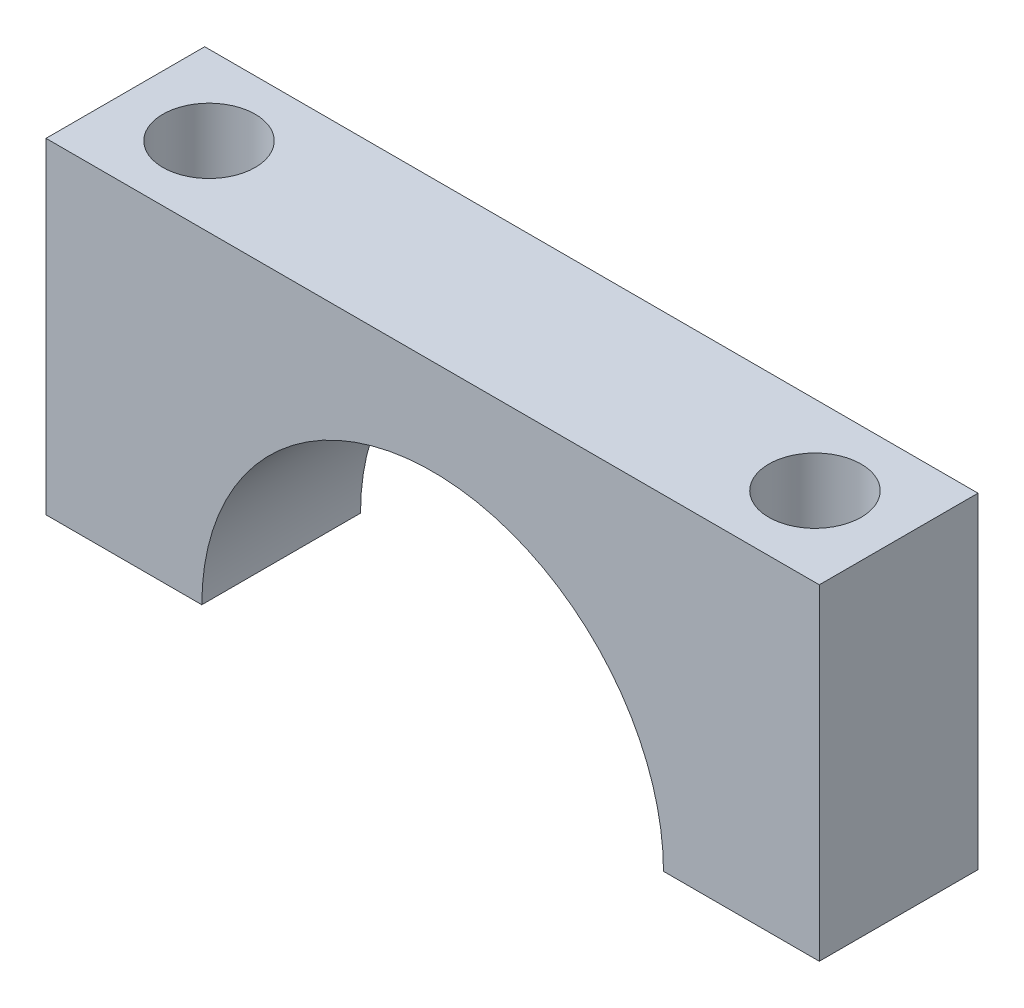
ISO-10303-21;
HEADER;
FILE_DESCRIPTION(('STEP AP214'),'2;1');
FILE_NAME('part.step','',(''),(''),'','','');
FILE_SCHEMA(('AUTOMOTIVE_DESIGN { 1 0 10303 214 1 1 1 1 }'));
ENDSEC;
DATA;
#1=APPLICATION_CONTEXT('core data for automotive mechanical design processes');
#2=APPLICATION_PROTOCOL_DEFINITION('international standard','automotive_design',2000,#1);
#3=PRODUCT_CONTEXT('',#1,'mechanical');
#4=PRODUCT('Part','Part','',(#3));
#5=PRODUCT_RELATED_PRODUCT_CATEGORY('part','',(#4));
#6=PRODUCT_DEFINITION_FORMATION('','',#4);
#7=PRODUCT_DEFINITION_CONTEXT('part definition',#1,'design');
#8=PRODUCT_DEFINITION('design','',#6,#7);
#9=PRODUCT_DEFINITION_SHAPE('','',#8);
#10=(LENGTH_UNIT() NAMED_UNIT(*) SI_UNIT(.MILLI.,.METRE.));
#11=(NAMED_UNIT(*) PLANE_ANGLE_UNIT() SI_UNIT($,.RADIAN.));
#12=(NAMED_UNIT(*) SI_UNIT($,.STERADIAN.) SOLID_ANGLE_UNIT());
#13=UNCERTAINTY_MEASURE_WITH_UNIT(LENGTH_MEASURE(1.E-05),#10,'distance_accuracy_value','');
#14=(GEOMETRIC_REPRESENTATION_CONTEXT(3) GLOBAL_UNCERTAINTY_ASSIGNED_CONTEXT((#13)) GLOBAL_UNIT_ASSIGNED_CONTEXT((#10,
#11,#12)) REPRESENTATION_CONTEXT('',''));
#15=CARTESIAN_POINT('',(0.,0.,0.));
#16=DIRECTION('',(0.,0.,1.));
#17=DIRECTION('',(1.,0.,0.));
#18=AXIS2_PLACEMENT_3D('',#15,#16,#17);
#19=CARTESIAN_POINT('',(-13.4,11.3,2.75));
#20=DIRECTION('',(1.,0.,0.));
#21=DIRECTION('',(0.,1.,0.));
#22=AXIS2_PLACEMENT_3D('',#19,#20,#21);
#23=PLANE('',#22);
#24=DIRECTION('',(0.,-1.,0.));
#25=VECTOR('',#24,1.);
#26=CARTESIAN_POINT('',(-13.4,11.3,-2.75));
#27=LINE('',#26,#25);
#28=CARTESIAN_POINT('',(-13.4,11.3,-2.75));
#29=VERTEX_POINT('',#28);
#30=CARTESIAN_POINT('',(-13.4,0.,-2.75));
#31=VERTEX_POINT('',#30);
#32=EDGE_CURVE('E118',#29,#31,#27,.T.);
#33=ORIENTED_EDGE('',*,*,#32,.T.);
#34=DIRECTION('',(0.,0.,-1.));
#35=VECTOR('',#34,1.);
#36=CARTESIAN_POINT('',(-13.4,0.,2.75));
#37=LINE('',#36,#35);
#38=CARTESIAN_POINT('',(-13.4,0.,2.75));
#39=VERTEX_POINT('',#38);
#40=EDGE_CURVE('E11',#39,#31,#37,.T.);
#41=ORIENTED_EDGE('',*,*,#40,.F.);
#42=DIRECTION('',(0.,-1.,0.));
#43=VECTOR('',#42,1.);
#44=CARTESIAN_POINT('',(-13.4,11.3,2.75));
#45=LINE('',#44,#43);
#46=CARTESIAN_POINT('',(-13.4,11.3,2.75));
#47=VERTEX_POINT('',#46);
#48=EDGE_CURVE('E129',#47,#39,#45,.T.);
#49=ORIENTED_EDGE('',*,*,#48,.F.);
#50=DIRECTION('',(0.,0.,-1.));
#51=VECTOR('',#50,1.);
#52=CARTESIAN_POINT('',(-13.4,11.3,2.75));
#53=LINE('',#52,#51);
#54=EDGE_CURVE('E114',#47,#29,#53,.T.);
#55=ORIENTED_EDGE('',*,*,#54,.T.);
#56=EDGE_LOOP('',(#33,#41,#49,#55));
#57=FACE_BOUND('',#56,.T.);
#58=ADVANCED_FACE('F34',(#57),#23,.F.);
#59=CARTESIAN_POINT('',(-13.4,0.,2.75));
#60=DIRECTION('',(0.,1.,0.));
#61=DIRECTION('',(-1.,0.,0.));
#62=AXIS2_PLACEMENT_3D('',#59,#60,#61);
#63=PLANE('',#62);
#64=CARTESIAN_POINT('',(-10.5,0.,0.));
#65=DIRECTION('',(0.,-1.,0.));
#66=DIRECTION('',(1.,0.,0.));
#67=AXIS2_PLACEMENT_3D('',#64,#65,#66);
#68=CIRCLE('',#67,1.6);
#69=CARTESIAN_POINT('',(-8.9,0.,0.));
#70=VERTEX_POINT('',#69);
#71=EDGE_CURVE('E178',#70,#70,#68,.T.);
#72=ORIENTED_EDGE('',*,*,#71,.F.);
#73=EDGE_LOOP('',(#72));
#74=FACE_BOUND('',#73,.T.);
#75=DIRECTION('',(1.,0.,0.));
#76=VECTOR('',#75,1.);
#77=CARTESIAN_POINT('',(-13.4,0.,-2.75));
#78=LINE('',#77,#76);
#79=CARTESIAN_POINT('',(-8.,0.,-2.75));
#80=VERTEX_POINT('',#79);
#81=EDGE_CURVE('E121',#31,#80,#78,.T.);
#82=ORIENTED_EDGE('',*,*,#81,.T.);
#83=DIRECTION('',(0.,0.,-1.));
#84=VECTOR('',#83,1.);
#85=CARTESIAN_POINT('',(-8.,0.,2.75));
#86=LINE('',#85,#84);
#87=CARTESIAN_POINT('',(-8.,0.,2.75));
#88=VERTEX_POINT('',#87);
#89=EDGE_CURVE('E42',#88,#80,#86,.T.);
#90=ORIENTED_EDGE('',*,*,#89,.F.);
#91=DIRECTION('',(1.,0.,0.));
#92=VECTOR('',#91,1.);
#93=CARTESIAN_POINT('',(-13.4,0.,2.75));
#94=LINE('',#93,#92);
#95=EDGE_CURVE('E87',#39,#88,#94,.T.);
#96=ORIENTED_EDGE('',*,*,#95,.F.);
#97=ORIENTED_EDGE('',*,*,#40,.T.);
#98=EDGE_LOOP('',(#82,#90,#96,#97));
#99=FACE_BOUND('',#98,.T.);
#100=ADVANCED_FACE('F156',(#74,#99),#63,.F.);
#101=CARTESIAN_POINT('',(0.,0.,2.75));
#102=DIRECTION('',(0.,0.,-1.));
#103=DIRECTION('',(-1.,0.,0.));
#104=AXIS2_PLACEMENT_3D('',#101,#102,#103);
#105=CYLINDRICAL_SURFACE('',#104,8.);
#106=CARTESIAN_POINT('',(0.,0.,-2.75));
#107=DIRECTION('',(0.,0.,-1.));
#108=DIRECTION('',(1.,0.,0.));
#109=AXIS2_PLACEMENT_3D('',#106,#107,#108);
#110=CIRCLE('',#109,8.);
#111=CARTESIAN_POINT('',(8.,0.,-2.75));
#112=VERTEX_POINT('',#111);
#113=EDGE_CURVE('E124',#80,#112,#110,.T.);
#114=ORIENTED_EDGE('',*,*,#113,.T.);
#115=DIRECTION('',(0.,0.,-1.));
#116=VECTOR('',#115,1.);
#117=CARTESIAN_POINT('',(8.,0.,2.75));
#118=LINE('',#117,#116);
#119=CARTESIAN_POINT('',(8.,0.,2.75));
#120=VERTEX_POINT('',#119);
#121=EDGE_CURVE('E109',#120,#112,#118,.T.);
#122=ORIENTED_EDGE('',*,*,#121,.F.);
#123=CARTESIAN_POINT('',(0.,0.,2.75));
#124=DIRECTION('',(0.,0.,-1.));
#125=DIRECTION('',(1.,0.,0.));
#126=AXIS2_PLACEMENT_3D('',#123,#124,#125);
#127=CIRCLE('',#126,8.);
#128=EDGE_CURVE('E100',#88,#120,#127,.T.);
#129=ORIENTED_EDGE('',*,*,#128,.F.);
#130=ORIENTED_EDGE('',*,*,#89,.T.);
#131=EDGE_LOOP('',(#114,#122,#129,#130));
#132=FACE_BOUND('',#131,.T.);
#133=ADVANCED_FACE('F135',(#132),#105,.F.);
#134=CARTESIAN_POINT('',(8.,0.,2.75));
#135=DIRECTION('',(0.,1.,0.));
#136=DIRECTION('',(-1.,0.,0.));
#137=AXIS2_PLACEMENT_3D('',#134,#135,#136);
#138=PLANE('',#137);
#139=CARTESIAN_POINT('',(10.5,0.,0.));
#140=DIRECTION('',(0.,-1.,0.));
#141=DIRECTION('',(1.,0.,0.));
#142=AXIS2_PLACEMENT_3D('',#139,#140,#141);
#143=CIRCLE('',#142,1.6);
#144=CARTESIAN_POINT('',(12.1,0.,0.));
#145=VERTEX_POINT('',#144);
#146=EDGE_CURVE('E173',#145,#145,#143,.T.);
#147=ORIENTED_EDGE('',*,*,#146,.F.);
#148=EDGE_LOOP('',(#147));
#149=FACE_BOUND('',#148,.T.);
#150=DIRECTION('',(1.,0.,0.));
#151=VECTOR('',#150,1.);
#152=CARTESIAN_POINT('',(8.,0.,-2.75));
#153=LINE('',#152,#151);
#154=CARTESIAN_POINT('',(13.4,0.,-2.75));
#155=VERTEX_POINT('',#154);
#156=EDGE_CURVE('E108',#112,#155,#153,.T.);
#157=ORIENTED_EDGE('',*,*,#156,.T.);
#158=DIRECTION('',(0.,0.,-1.));
#159=VECTOR('',#158,1.);
#160=CARTESIAN_POINT('',(13.4,0.,2.75));
#161=LINE('',#160,#159);
#162=CARTESIAN_POINT('',(13.4,0.,2.75));
#163=VERTEX_POINT('',#162);
#164=EDGE_CURVE('E105',#163,#155,#161,.T.);
#165=ORIENTED_EDGE('',*,*,#164,.F.);
#166=DIRECTION('',(1.,0.,0.));
#167=VECTOR('',#166,1.);
#168=CARTESIAN_POINT('',(8.,0.,2.75));
#169=LINE('',#168,#167);
#170=EDGE_CURVE('E94',#120,#163,#169,.T.);
#171=ORIENTED_EDGE('',*,*,#170,.F.);
#172=ORIENTED_EDGE('',*,*,#121,.T.);
#173=EDGE_LOOP('',(#157,#165,#171,#172));
#174=FACE_BOUND('',#173,.T.);
#175=ADVANCED_FACE('F106',(#149,#174),#138,.F.);
#176=CARTESIAN_POINT('',(13.4,11.3,2.75));
#177=DIRECTION('',(-1.,0.,0.));
#178=DIRECTION('',(0.,-1.,0.));
#179=AXIS2_PLACEMENT_3D('',#176,#177,#178);
#180=PLANE('',#179);
#181=DIRECTION('',(0.,1.,0.));
#182=VECTOR('',#181,1.);
#183=CARTESIAN_POINT('',(13.4,11.3,-2.75));
#184=LINE('',#183,#182);
#185=CARTESIAN_POINT('',(13.4,11.3,-2.75));
#186=VERTEX_POINT('',#185);
#187=EDGE_CURVE('E73',#155,#186,#184,.T.);
#188=ORIENTED_EDGE('',*,*,#187,.T.);
#189=DIRECTION('',(0.,0.,-1.));
#190=VECTOR('',#189,1.);
#191=CARTESIAN_POINT('',(13.4,11.3,2.75));
#192=LINE('',#191,#190);
#193=CARTESIAN_POINT('',(13.4,11.3,2.75));
#194=VERTEX_POINT('',#193);
#195=EDGE_CURVE('E110',#194,#186,#192,.T.);
#196=ORIENTED_EDGE('',*,*,#195,.F.);
#197=DIRECTION('',(0.,1.,0.));
#198=VECTOR('',#197,1.);
#199=CARTESIAN_POINT('',(13.4,11.3,2.75));
#200=LINE('',#199,#198);
#201=EDGE_CURVE('E98',#163,#194,#200,.T.);
#202=ORIENTED_EDGE('',*,*,#201,.F.);
#203=ORIENTED_EDGE('',*,*,#164,.T.);
#204=EDGE_LOOP('',(#188,#196,#202,#203));
#205=FACE_BOUND('',#204,.T.);
#206=ADVANCED_FACE('F112',(#205),#180,.F.);
#207=CARTESIAN_POINT('',(-13.4,11.3,2.75));
#208=DIRECTION('',(0.,-1.,0.));
#209=DIRECTION('',(1.,0.,0.));
#210=AXIS2_PLACEMENT_3D('',#207,#208,#209);
#211=PLANE('',#210);
#212=CARTESIAN_POINT('',(-10.5,11.3,0.));
#213=DIRECTION('',(0.,-1.,0.));
#214=DIRECTION('',(1.,0.,0.));
#215=AXIS2_PLACEMENT_3D('',#212,#213,#214);
#216=CIRCLE('',#215,1.6);
#217=CARTESIAN_POINT('',(-8.90000000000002,11.3,0.));
#218=VERTEX_POINT('',#217);
#219=EDGE_CURVE('E122',#218,#218,#216,.T.);
#220=ORIENTED_EDGE('',*,*,#219,.T.);
#221=EDGE_LOOP('',(#220));
#222=FACE_BOUND('',#221,.T.);
#223=CARTESIAN_POINT('',(10.5,11.3,0.));
#224=DIRECTION('',(0.,-1.,0.));
#225=DIRECTION('',(1.,0.,0.));
#226=AXIS2_PLACEMENT_3D('',#223,#224,#225);
#227=CIRCLE('',#226,1.6);
#228=CARTESIAN_POINT('',(12.1,11.3,0.));
#229=VERTEX_POINT('',#228);
#230=EDGE_CURVE('E175',#229,#229,#227,.T.);
#231=ORIENTED_EDGE('',*,*,#230,.T.);
#232=EDGE_LOOP('',(#231));
#233=FACE_BOUND('',#232,.T.);
#234=DIRECTION('',(-1.,0.,0.));
#235=VECTOR('',#234,1.);
#236=CARTESIAN_POINT('',(-13.4,11.3,-2.75));
#237=LINE('',#236,#235);
#238=EDGE_CURVE('E79',#186,#29,#237,.T.);
#239=ORIENTED_EDGE('',*,*,#238,.T.);
#240=ORIENTED_EDGE('',*,*,#54,.F.);
#241=DIRECTION('',(-1.,0.,0.));
#242=VECTOR('',#241,1.);
#243=CARTESIAN_POINT('',(-13.4,11.3,2.75));
#244=LINE('',#243,#242);
#245=EDGE_CURVE('E50',#194,#47,#244,.T.);
#246=ORIENTED_EDGE('',*,*,#245,.F.);
#247=ORIENTED_EDGE('',*,*,#195,.T.);
#248=EDGE_LOOP('',(#239,#240,#246,#247));
#249=FACE_BOUND('',#248,.T.);
#250=ADVANCED_FACE('F142',(#222,#233,#249),#211,.F.);
#251=CARTESIAN_POINT('',(0.,0.,2.75));
#252=DIRECTION('',(0.,0.,1.));
#253=DIRECTION('',(1.,0.,0.));
#254=AXIS2_PLACEMENT_3D('',#251,#252,#253);
#255=PLANE('',#254);
#256=ORIENTED_EDGE('',*,*,#48,.T.);
#257=ORIENTED_EDGE('',*,*,#95,.T.);
#258=ORIENTED_EDGE('',*,*,#128,.T.);
#259=ORIENTED_EDGE('',*,*,#170,.T.);
#260=ORIENTED_EDGE('',*,*,#201,.T.);
#261=ORIENTED_EDGE('',*,*,#245,.T.);
#262=EDGE_LOOP('',(#256,#257,#258,#259,#260,#261));
#263=FACE_BOUND('',#262,.T.);
#264=ADVANCED_FACE('F96',(#263),#255,.T.);
#265=CARTESIAN_POINT('',(0.,0.,-2.75));
#266=DIRECTION('',(0.,0.,1.));
#267=DIRECTION('',(1.,0.,0.));
#268=AXIS2_PLACEMENT_3D('',#265,#266,#267);
#269=PLANE('',#268);
#270=ORIENTED_EDGE('',*,*,#32,.F.);
#271=ORIENTED_EDGE('',*,*,#238,.F.);
#272=ORIENTED_EDGE('',*,*,#187,.F.);
#273=ORIENTED_EDGE('',*,*,#156,.F.);
#274=ORIENTED_EDGE('',*,*,#113,.F.);
#275=ORIENTED_EDGE('',*,*,#81,.F.);
#276=EDGE_LOOP('',(#270,#271,#272,#273,#274,#275));
#277=FACE_BOUND('',#276,.T.);
#278=ADVANCED_FACE('F138',(#277),#269,.F.);
#279=CARTESIAN_POINT('',(10.5,11.3,0.));
#280=DIRECTION('',(0.,-1.,0.));
#281=DIRECTION('',(1.,0.,0.));
#282=AXIS2_PLACEMENT_3D('',#279,#280,#281);
#283=CYLINDRICAL_SURFACE('',#282,1.6);
#284=ORIENTED_EDGE('',*,*,#230,.F.);
#285=EDGE_LOOP('',(#284));
#286=FACE_BOUND('',#285,.T.);
#287=ORIENTED_EDGE('',*,*,#146,.T.);
#288=EDGE_LOOP('',(#287));
#289=FACE_BOUND('',#288,.T.);
#290=ADVANCED_FACE('F190',(#286,#289),#283,.F.);
#291=CARTESIAN_POINT('',(-10.5,11.3,0.));
#292=DIRECTION('',(0.,-1.,0.));
#293=DIRECTION('',(1.,0.,0.));
#294=AXIS2_PLACEMENT_3D('',#291,#292,#293);
#295=CYLINDRICAL_SURFACE('',#294,1.6);
#296=ORIENTED_EDGE('',*,*,#219,.F.);
#297=EDGE_LOOP('',(#296));
#298=FACE_BOUND('',#297,.T.);
#299=ORIENTED_EDGE('',*,*,#71,.T.);
#300=EDGE_LOOP('',(#299));
#301=FACE_BOUND('',#300,.T.);
#302=ADVANCED_FACE('F187',(#298,#301),#295,.F.);
#303=CLOSED_SHELL('',(#58,#100,#133,#175,#206,#250,#264,#278,#290,#302));
#304=MANIFOLD_SOLID_BREP('B2',#303);
#305=ADVANCED_BREP_SHAPE_REPRESENTATION('',(#18,#304),#14);
#306=SHAPE_DEFINITION_REPRESENTATION(#9,#305);
ENDSEC;
END-ISO-10303-21;
